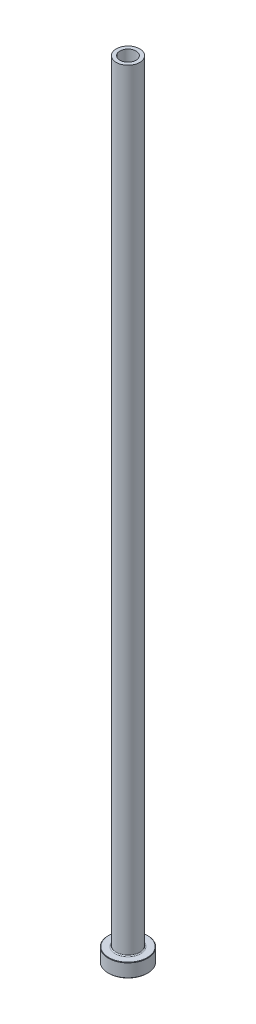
from build123d import *

# Parameters (mm, degrees)
FILLET1_R     = 0.5
CHAMFER1_SIZE = 0.2
CHAMFER3_SIZE = 0.5


with BuildPart() as part:
    # Sketch1 → Revolve1 (revolve)
    with BuildSketch(Plane.XY, mode=Mode.PRIVATE) as revolve1_sk:
        Polygon((-4.1, 400), (-6, 400), (-6, 7), (-10, 7), (-10, 0), (-4.35, 0), (-4.35, 343), (-4.1, 355), align=None)
    revolve(revolve1_sk.sketch.rotate(Axis((0, 92.187680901, 0), (0, -1, 0)), 270), axis=Axis((0, 92.187680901, 0), (0, -1, 0)))

    # Fillet1
    fillet1_edges = [part.edges().sort_by_distance(p)[0] for p in [
        (0, 7, -6),
    ]]
    fillet(fillet1_edges, radius=FILLET1_R)

    # Chamfer1
    chamfer1_edges = [part.edges().sort_by_distance(p)[0] for p in [
        (0, 0, -10),
        (0, 7, -10),
    ]]
    chamfer(chamfer1_edges, length=CHAMFER1_SIZE)

    # Chamfer3
    chamfer3_edges = [part.edges().sort_by_distance(p)[0] for p in [
        (0, 0, -4.35),
    ]]
    chamfer(chamfer3_edges, length=CHAMFER3_SIZE)


solid = part.part
